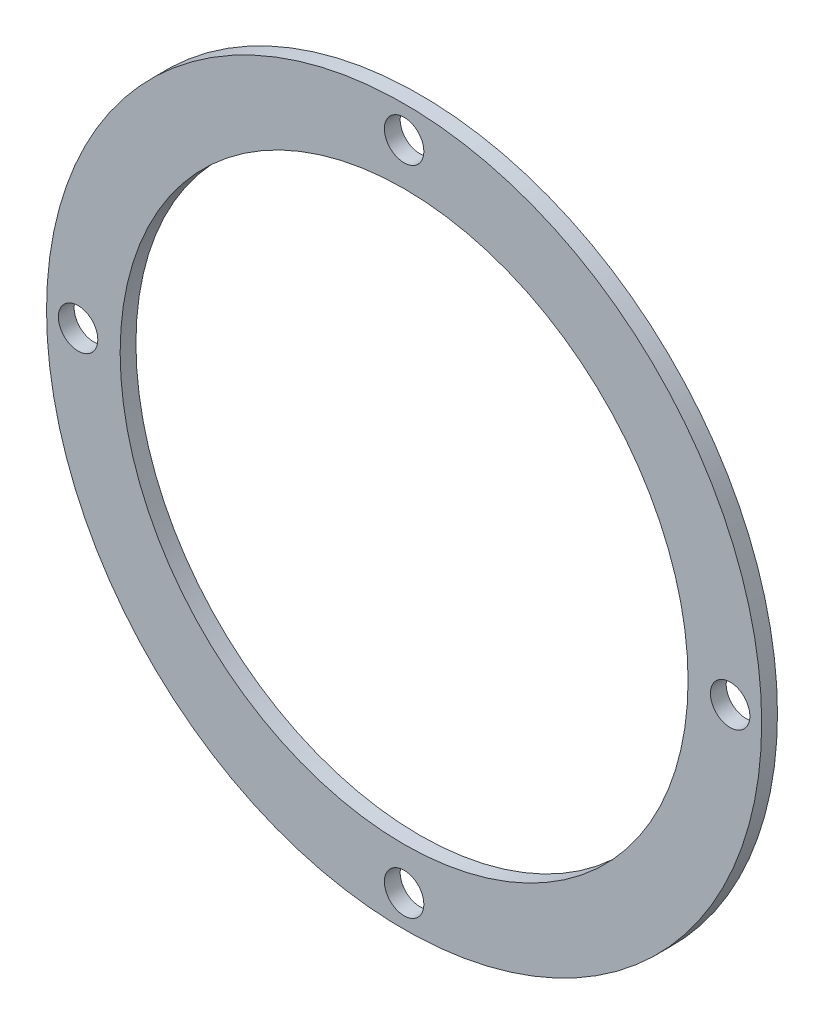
ISO-10303-21;
HEADER;
FILE_DESCRIPTION(('STEP AP214'),'2;1');
FILE_NAME('part.step','',(''),(''),'','','');
FILE_SCHEMA(('AUTOMOTIVE_DESIGN { 1 0 10303 214 1 1 1 1 }'));
ENDSEC;
DATA;
#1=APPLICATION_CONTEXT('core data for automotive mechanical design processes');
#2=APPLICATION_PROTOCOL_DEFINITION('international standard','automotive_design',2000,#1);
#3=PRODUCT_CONTEXT('',#1,'mechanical');
#4=PRODUCT('Part','Part','',(#3));
#5=PRODUCT_RELATED_PRODUCT_CATEGORY('part','',(#4));
#6=PRODUCT_DEFINITION_FORMATION('','',#4);
#7=PRODUCT_DEFINITION_CONTEXT('part definition',#1,'design');
#8=PRODUCT_DEFINITION('design','',#6,#7);
#9=PRODUCT_DEFINITION_SHAPE('','',#8);
#10=(LENGTH_UNIT() NAMED_UNIT(*) SI_UNIT(.MILLI.,.METRE.));
#11=(NAMED_UNIT(*) PLANE_ANGLE_UNIT() SI_UNIT($,.RADIAN.));
#12=(NAMED_UNIT(*) SI_UNIT($,.STERADIAN.) SOLID_ANGLE_UNIT());
#13=UNCERTAINTY_MEASURE_WITH_UNIT(LENGTH_MEASURE(1.E-05),#10,'distance_accuracy_value','');
#14=(GEOMETRIC_REPRESENTATION_CONTEXT(3) GLOBAL_UNCERTAINTY_ASSIGNED_CONTEXT((#13)) GLOBAL_UNIT_ASSIGNED_CONTEXT((#10,
#11,#12)) REPRESENTATION_CONTEXT('',''));
#15=CARTESIAN_POINT('',(0.,0.,0.));
#16=DIRECTION('',(0.,0.,1.));
#17=DIRECTION('',(1.,0.,0.));
#18=AXIS2_PLACEMENT_3D('',#15,#16,#17);
#19=CARTESIAN_POINT('',(-1.11022302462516E-13,-1.11022302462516E-13,3.00000000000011));
#20=DIRECTION('',(0.,0.,1.));
#21=DIRECTION('',(1.,0.,0.));
#22=AXIS2_PLACEMENT_3D('',#19,#20,#21);
#23=PLANE('',#22);
#24=CARTESIAN_POINT('',(62.,-1.11022302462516E-13,2.99999999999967));
#25=DIRECTION('',(0.,0.,1.));
#26=DIRECTION('',(1.,0.,0.));
#27=AXIS2_PLACEMENT_3D('',#24,#25,#26);
#28=CIRCLE('',#27,3.75000000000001);
#29=CARTESIAN_POINT('',(65.75,-1.11334552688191E-13,2.99999999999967));
#30=VERTEX_POINT('',#29);
#31=EDGE_CURVE('E79',#30,#30,#28,.T.);
#32=ORIENTED_EDGE('',*,*,#31,.F.);
#33=EDGE_LOOP('',(#32));
#34=FACE_BOUND('',#33,.T.);
#35=CARTESIAN_POINT('',(1.11022302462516E-13,61.9999999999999,2.99999999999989));
#36=DIRECTION('',(0.,0.,1.));
#37=DIRECTION('',(1.,0.,0.));
#38=AXIS2_PLACEMENT_3D('',#35,#36,#37);
#39=CIRCLE('',#38,3.75);
#40=CARTESIAN_POINT('',(3.75000000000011,61.9999999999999,2.99999999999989));
#41=VERTEX_POINT('',#40);
#42=EDGE_CURVE('E67',#41,#41,#39,.T.);
#43=ORIENTED_EDGE('',*,*,#42,.F.);
#44=EDGE_LOOP('',(#43));
#45=FACE_BOUND('',#44,.T.);
#46=CARTESIAN_POINT('',(-1.11022302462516E-13,-1.11022302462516E-13,3.00000000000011));
#47=DIRECTION('',(0.,0.,1.));
#48=DIRECTION('',(1.,0.,0.));
#49=AXIS2_PLACEMENT_3D('',#46,#47,#48);
#50=CIRCLE('',#49,68.);
#51=CARTESIAN_POINT('',(67.9999999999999,-1.16684439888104E-13,3.00000000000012));
#52=VERTEX_POINT('',#51);
#53=EDGE_CURVE('E12',#52,#52,#50,.T.);
#54=ORIENTED_EDGE('',*,*,#53,.T.);
#55=EDGE_LOOP('',(#54));
#56=FACE_BOUND('',#55,.T.);
#57=CARTESIAN_POINT('',(-1.11022302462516E-13,-1.11022302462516E-13,3.00000000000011));
#58=DIRECTION('',(0.,0.,1.));
#59=DIRECTION('',(1.,0.,0.));
#60=AXIS2_PLACEMENT_3D('',#57,#58,#59);
#61=CIRCLE('',#60,54.);
#62=CARTESIAN_POINT('',(53.9999999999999,-1.15518705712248E-13,3.00000000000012));
#63=VERTEX_POINT('',#62);
#64=EDGE_CURVE('E56',#63,#63,#61,.T.);
#65=ORIENTED_EDGE('',*,*,#64,.F.);
#66=EDGE_LOOP('',(#65));
#67=FACE_BOUND('',#66,.T.);
#68=CARTESIAN_POINT('',(-62.0000000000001,1.11022302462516E-13,2.99999999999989));
#69=DIRECTION('',(0.,0.,1.));
#70=DIRECTION('',(1.,0.,0.));
#71=AXIS2_PLACEMENT_3D('',#68,#69,#70);
#72=CIRCLE('',#71,3.75000000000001);
#73=CARTESIAN_POINT('',(-58.25,1.1071005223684E-13,2.99999999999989));
#74=VERTEX_POINT('',#73);
#75=EDGE_CURVE('E73',#74,#74,#72,.T.);
#76=ORIENTED_EDGE('',*,*,#75,.F.);
#77=EDGE_LOOP('',(#76));
#78=FACE_BOUND('',#77,.T.);
#79=CARTESIAN_POINT('',(1.11022302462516E-13,-61.9999999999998,3.00000000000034));
#80=DIRECTION('',(0.,0.,1.));
#81=DIRECTION('',(1.,0.,0.));
#82=AXIS2_PLACEMENT_3D('',#79,#80,#81);
#83=CIRCLE('',#82,3.75);
#84=CARTESIAN_POINT('',(3.75000000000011,-61.9999999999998,3.00000000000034));
#85=VERTEX_POINT('',#84);
#86=EDGE_CURVE('E85',#85,#85,#83,.T.);
#87=ORIENTED_EDGE('',*,*,#86,.F.);
#88=EDGE_LOOP('',(#87));
#89=FACE_BOUND('',#88,.T.);
#90=ADVANCED_FACE('F44',(#34,#45,#56,#67,#78,#89),#23,.T.);
#91=CARTESIAN_POINT('',(2.22044604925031E-13,1.11022302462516E-13,2.22044604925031E-13));
#92=DIRECTION('',(0.,0.,1.));
#93=DIRECTION('',(1.,0.,0.));
#94=AXIS2_PLACEMENT_3D('',#91,#92,#93);
#95=PLANE('',#94);
#96=CARTESIAN_POINT('',(61.9999999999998,2.22044604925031E-13,2.22044604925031E-13));
#97=DIRECTION('',(0.,0.,1.));
#98=DIRECTION('',(1.,0.,0.));
#99=AXIS2_PLACEMENT_3D('',#96,#97,#98);
#100=CIRCLE('',#99,3.75000000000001);
#101=CARTESIAN_POINT('',(65.7499999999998,2.21732354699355E-13,2.22252771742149E-13));
#102=VERTEX_POINT('',#101);
#103=EDGE_CURVE('E82',#102,#102,#100,.T.);
#104=ORIENTED_EDGE('',*,*,#103,.T.);
#105=EDGE_LOOP('',(#104));
#106=FACE_BOUND('',#105,.T.);
#107=CARTESIAN_POINT('',(0.,61.9999999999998,-4.44089209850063E-13));
#108=DIRECTION('',(0.,0.,1.));
#109=DIRECTION('',(1.,0.,0.));
#110=AXIS2_PLACEMENT_3D('',#107,#108,#109);
#111=CIRCLE('',#110,3.75);
#112=CARTESIAN_POINT('',(3.74999999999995,61.9999999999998,-4.43881043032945E-13));
#113=VERTEX_POINT('',#112);
#114=EDGE_CURVE('E70',#113,#113,#111,.T.);
#115=ORIENTED_EDGE('',*,*,#114,.T.);
#116=EDGE_LOOP('',(#115));
#117=FACE_BOUND('',#116,.T.);
#118=CARTESIAN_POINT('',(2.22044604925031E-13,1.11022302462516E-13,2.22044604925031E-13));
#119=DIRECTION('',(0.,0.,1.));
#120=DIRECTION('',(1.,0.,0.));
#121=AXIS2_PLACEMENT_3D('',#118,#119,#120);
#122=CIRCLE('',#121,68.);
#123=CARTESIAN_POINT('',(68.0000000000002,1.05360165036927E-13,2.25819363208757E-13));
#124=VERTEX_POINT('',#123);
#125=EDGE_CURVE('E51',#124,#124,#122,.T.);
#126=ORIENTED_EDGE('',*,*,#125,.F.);
#127=EDGE_LOOP('',(#126));
#128=FACE_BOUND('',#127,.T.);
#129=CARTESIAN_POINT('',(2.22044604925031E-13,1.11022302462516E-13,2.22044604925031E-13));
#130=DIRECTION('',(0.,0.,1.));
#131=DIRECTION('',(1.,0.,0.));
#132=AXIS2_PLACEMENT_3D('',#129,#130,#131);
#133=CIRCLE('',#132,54.);
#134=CARTESIAN_POINT('',(54.0000000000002,1.06525899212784E-13,2.25042207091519E-13));
#135=VERTEX_POINT('',#134);
#136=EDGE_CURVE('E62',#135,#135,#133,.T.);
#137=ORIENTED_EDGE('',*,*,#136,.T.);
#138=EDGE_LOOP('',(#137));
#139=FACE_BOUND('',#138,.T.);
#140=CARTESIAN_POINT('',(-62.0000000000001,-1.11022302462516E-13,-4.44089209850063E-13));
#141=DIRECTION('',(0.,0.,1.));
#142=DIRECTION('',(1.,0.,0.));
#143=AXIS2_PLACEMENT_3D('',#140,#141,#142);
#144=CIRCLE('',#143,3.75000000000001);
#145=CARTESIAN_POINT('',(-58.2500000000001,-1.11334552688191E-13,-4.43881043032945E-13));
#146=VERTEX_POINT('',#145);
#147=EDGE_CURVE('E76',#146,#146,#144,.T.);
#148=ORIENTED_EDGE('',*,*,#147,.T.);
#149=EDGE_LOOP('',(#148));
#150=FACE_BOUND('',#149,.T.);
#151=CARTESIAN_POINT('',(-2.22044604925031E-13,-62.0000000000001,-2.22044604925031E-13));
#152=DIRECTION('',(0.,0.,1.));
#153=DIRECTION('',(1.,0.,0.));
#154=AXIS2_PLACEMENT_3D('',#151,#152,#153);
#155=CIRCLE('',#154,3.75);
#156=CARTESIAN_POINT('',(3.74999999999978,-62.0000000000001,-2.21836438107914E-13));
#157=VERTEX_POINT('',#156);
#158=EDGE_CURVE('E88',#157,#157,#155,.T.);
#159=ORIENTED_EDGE('',*,*,#158,.T.);
#160=EDGE_LOOP('',(#159));
#161=FACE_BOUND('',#160,.T.);
#162=ADVANCED_FACE('F92',(#106,#117,#128,#139,#150,#161),#95,.F.);
#163=CARTESIAN_POINT('',(-1.11022302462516E-13,-1.11022302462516E-13,3.00000000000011));
#164=DIRECTION('',(0.,0.,-1.));
#165=DIRECTION('',(-1.,0.,0.));
#166=AXIS2_PLACEMENT_3D('',#163,#164,#165);
#167=CYLINDRICAL_SURFACE('',#166,68.);
#168=ORIENTED_EDGE('',*,*,#53,.F.);
#169=EDGE_LOOP('',(#168));
#170=FACE_BOUND('',#169,.T.);
#171=ORIENTED_EDGE('',*,*,#125,.T.);
#172=EDGE_LOOP('',(#171));
#173=FACE_BOUND('',#172,.T.);
#174=ADVANCED_FACE('F46',(#170,#173),#167,.T.);
#175=CARTESIAN_POINT('',(-1.11022302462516E-13,-1.11022302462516E-13,3.00000000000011));
#176=DIRECTION('',(0.,0.,-1.));
#177=DIRECTION('',(-1.,0.,0.));
#178=AXIS2_PLACEMENT_3D('',#175,#176,#177);
#179=CYLINDRICAL_SURFACE('',#178,54.);
#180=ORIENTED_EDGE('',*,*,#64,.T.);
#181=EDGE_LOOP('',(#180));
#182=FACE_BOUND('',#181,.T.);
#183=ORIENTED_EDGE('',*,*,#136,.F.);
#184=EDGE_LOOP('',(#183));
#185=FACE_BOUND('',#184,.T.);
#186=ADVANCED_FACE('F114',(#182,#185),#179,.F.);
#187=CARTESIAN_POINT('',(1.11022302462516E-13,61.9999999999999,2.99999999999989));
#188=DIRECTION('',(0.,0.,-1.));
#189=DIRECTION('',(-1.,0.,0.));
#190=AXIS2_PLACEMENT_3D('',#187,#188,#189);
#191=CYLINDRICAL_SURFACE('',#190,3.75);
#192=ORIENTED_EDGE('',*,*,#42,.T.);
#193=EDGE_LOOP('',(#192));
#194=FACE_BOUND('',#193,.T.);
#195=ORIENTED_EDGE('',*,*,#114,.F.);
#196=EDGE_LOOP('',(#195));
#197=FACE_BOUND('',#196,.T.);
#198=ADVANCED_FACE('F117',(#194,#197),#191,.F.);
#199=CARTESIAN_POINT('',(-62.0000000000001,1.11022302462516E-13,2.99999999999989));
#200=DIRECTION('',(0.,0.,-1.));
#201=DIRECTION('',(-1.,0.,0.));
#202=AXIS2_PLACEMENT_3D('',#199,#200,#201);
#203=CYLINDRICAL_SURFACE('',#202,3.75000000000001);
#204=ORIENTED_EDGE('',*,*,#75,.T.);
#205=EDGE_LOOP('',(#204));
#206=FACE_BOUND('',#205,.T.);
#207=ORIENTED_EDGE('',*,*,#147,.F.);
#208=EDGE_LOOP('',(#207));
#209=FACE_BOUND('',#208,.T.);
#210=ADVANCED_FACE('F102',(#206,#209),#203,.F.);
#211=CARTESIAN_POINT('',(62.,-1.11022302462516E-13,2.99999999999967));
#212=DIRECTION('',(0.,0.,-1.));
#213=DIRECTION('',(-1.,0.,0.));
#214=AXIS2_PLACEMENT_3D('',#211,#212,#213);
#215=CYLINDRICAL_SURFACE('',#214,3.75000000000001);
#216=ORIENTED_EDGE('',*,*,#31,.T.);
#217=EDGE_LOOP('',(#216));
#218=FACE_BOUND('',#217,.T.);
#219=ORIENTED_EDGE('',*,*,#103,.F.);
#220=EDGE_LOOP('',(#219));
#221=FACE_BOUND('',#220,.T.);
#222=ADVANCED_FACE('F96',(#218,#221),#215,.F.);
#223=CARTESIAN_POINT('',(1.11022302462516E-13,-61.9999999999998,3.00000000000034));
#224=DIRECTION('',(0.,0.,-1.));
#225=DIRECTION('',(-1.,0.,0.));
#226=AXIS2_PLACEMENT_3D('',#223,#224,#225);
#227=CYLINDRICAL_SURFACE('',#226,3.75);
#228=ORIENTED_EDGE('',*,*,#86,.T.);
#229=EDGE_LOOP('',(#228));
#230=FACE_BOUND('',#229,.T.);
#231=ORIENTED_EDGE('',*,*,#158,.F.);
#232=EDGE_LOOP('',(#231));
#233=FACE_BOUND('',#232,.T.);
#234=ADVANCED_FACE('F94',(#230,#233),#227,.F.);
#235=CLOSED_SHELL('',(#90,#162,#174,#186,#198,#210,#222,#234));
#236=MANIFOLD_SOLID_BREP('B2',#235);
#237=ADVANCED_BREP_SHAPE_REPRESENTATION('',(#18,#236),#14);
#238=SHAPE_DEFINITION_REPRESENTATION(#9,#237);
ENDSEC;
END-ISO-10303-21;
